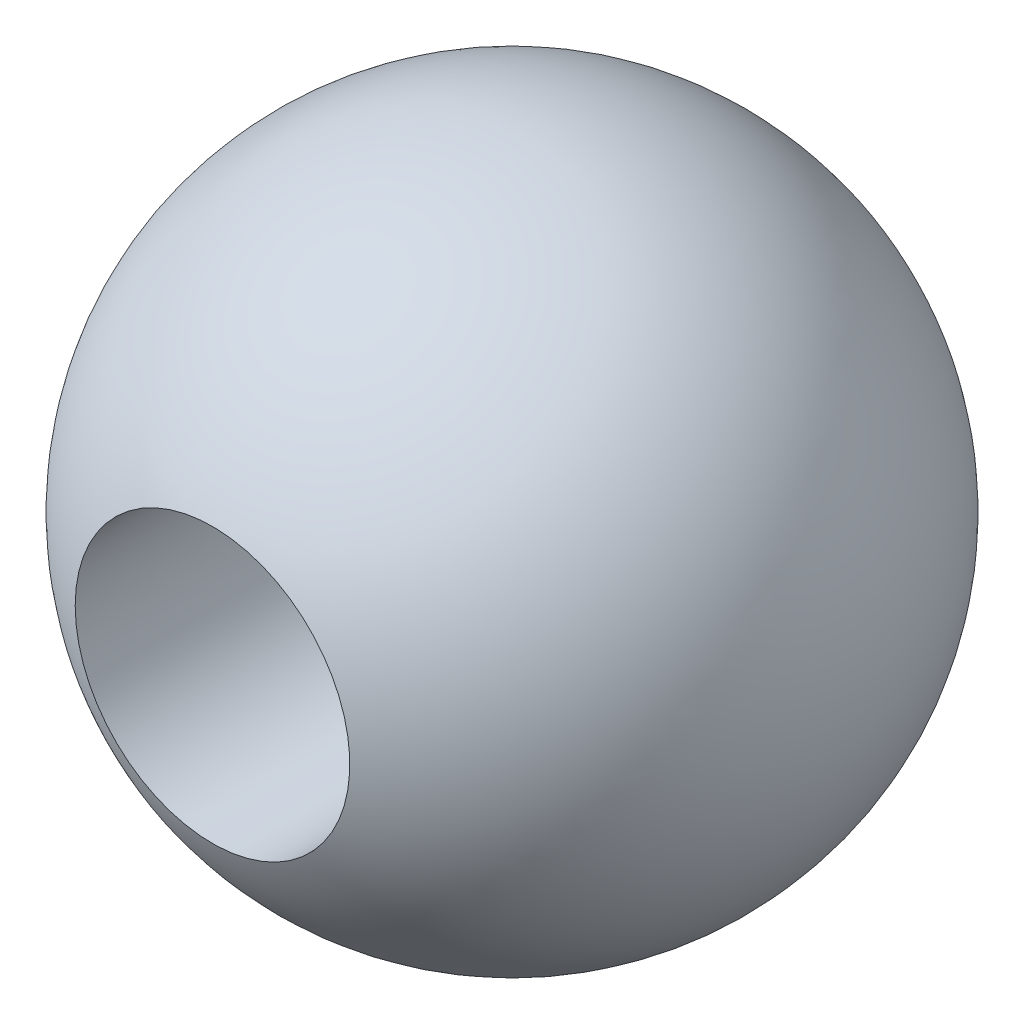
from build123d import *

# Parameters (mm, degrees)
SKETCH2_R          = 2.5
CUT_EXTRUDE1_DEPTH = 8


with BuildPart() as part:
    # Sketch1 → Revolve1 (revolve)
    with BuildSketch(Plane.XY):
        with BuildLine():
            Line((0, 0), (0, 12))
            ThreePointArc((0, 12), (6, 6), (0, 0))
        make_face()
    revolve(axis=Axis((0, 0, 0), (0, 1, 0)))

    # Sketch2 → Cut-Extrude1 (cut)
    with BuildSketch(Plane.XY):
        with Locations(Location((0, 6, 0), (0, 0, 180))):
            Circle(SKETCH2_R)
    extrude(amount=CUT_EXTRUDE1_DEPTH, mode=Mode.SUBTRACT)


solid = part.part
